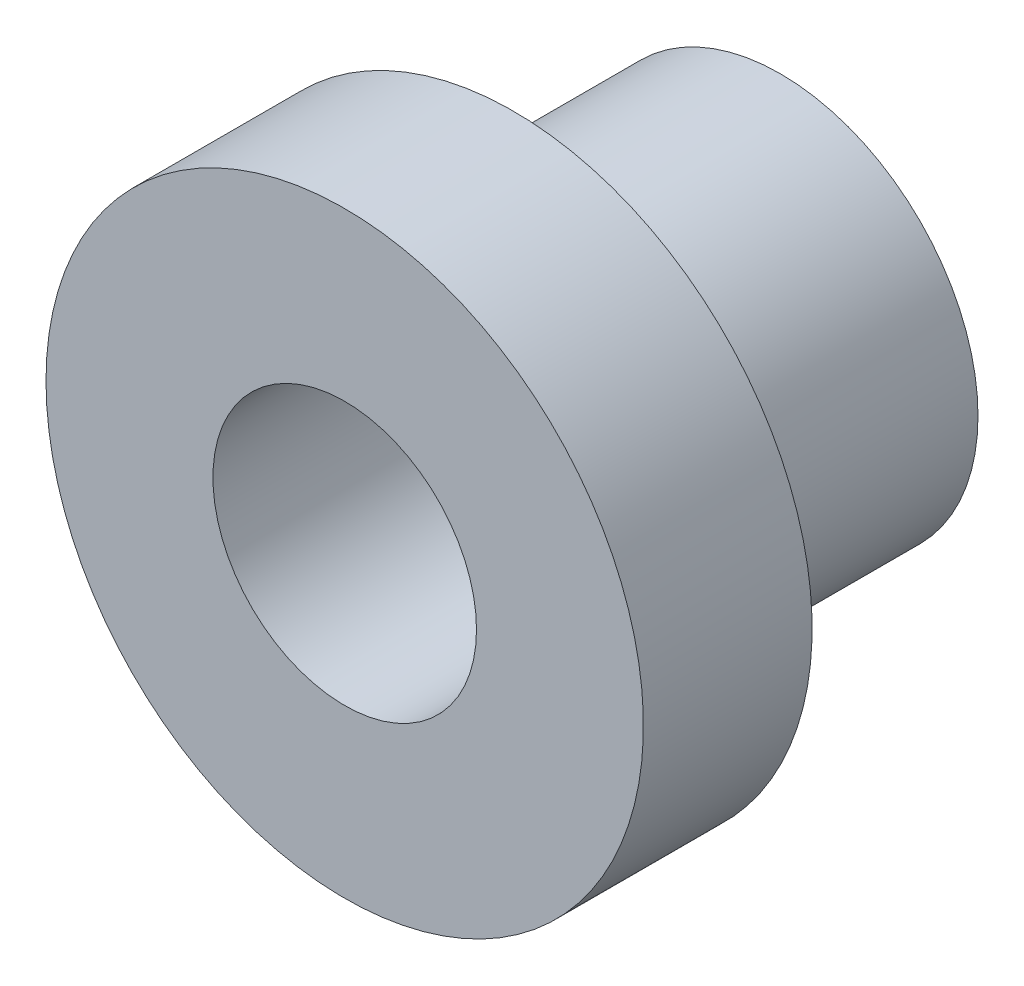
ISO-10303-21;
HEADER;
FILE_DESCRIPTION(('STEP AP214'),'2;1');
FILE_NAME('part.step','',(''),(''),'','','');
FILE_SCHEMA(('AUTOMOTIVE_DESIGN { 1 0 10303 214 1 1 1 1 }'));
ENDSEC;
DATA;
#1=APPLICATION_CONTEXT('core data for automotive mechanical design processes');
#2=APPLICATION_PROTOCOL_DEFINITION('international standard','automotive_design',2000,#1);
#3=PRODUCT_CONTEXT('',#1,'mechanical');
#4=PRODUCT('Part','Part','',(#3));
#5=PRODUCT_RELATED_PRODUCT_CATEGORY('part','',(#4));
#6=PRODUCT_DEFINITION_FORMATION('','',#4);
#7=PRODUCT_DEFINITION_CONTEXT('part definition',#1,'design');
#8=PRODUCT_DEFINITION('design','',#6,#7);
#9=PRODUCT_DEFINITION_SHAPE('','',#8);
#10=(LENGTH_UNIT() NAMED_UNIT(*) SI_UNIT(.MILLI.,.METRE.));
#11=(NAMED_UNIT(*) PLANE_ANGLE_UNIT() SI_UNIT($,.RADIAN.));
#12=(NAMED_UNIT(*) SI_UNIT($,.STERADIAN.) SOLID_ANGLE_UNIT());
#13=UNCERTAINTY_MEASURE_WITH_UNIT(LENGTH_MEASURE(1.E-05),#10,'distance_accuracy_value','');
#14=(GEOMETRIC_REPRESENTATION_CONTEXT(3) GLOBAL_UNCERTAINTY_ASSIGNED_CONTEXT((#13)) GLOBAL_UNIT_ASSIGNED_CONTEXT((#10,
#11,#12)) REPRESENTATION_CONTEXT('',''));
#15=CARTESIAN_POINT('',(0.,0.,0.));
#16=DIRECTION('',(0.,0.,1.));
#17=DIRECTION('',(1.,0.,0.));
#18=AXIS2_PLACEMENT_3D('',#15,#16,#17);
#19=CARTESIAN_POINT('',(0.,0.,0.));
#20=DIRECTION('',(0.,0.,1.));
#21=DIRECTION('',(1.,0.,0.));
#22=AXIS2_PLACEMENT_3D('',#19,#20,#21);
#23=PLANE('',#22);
#24=CARTESIAN_POINT('',(0.,0.,0.));
#25=DIRECTION('',(0.,0.,1.));
#26=DIRECTION('',(1.,0.,0.));
#27=AXIS2_PLACEMENT_3D('',#24,#25,#26);
#28=CIRCLE('',#27,10.795);
#29=CARTESIAN_POINT('',(-10.795,0.,0.));
#30=VERTEX_POINT('',#29);
#31=EDGE_CURVE('E50',#30,#30,#28,.T.);
#32=ORIENTED_EDGE('',*,*,#31,.F.);
#33=EDGE_LOOP('',(#32));
#34=FACE_BOUND('',#33,.T.);
#35=CARTESIAN_POINT('',(0.,0.,0.));
#36=DIRECTION('',(0.,0.,1.));
#37=DIRECTION('',(1.,0.,0.));
#38=AXIS2_PLACEMENT_3D('',#35,#36,#37);
#39=CIRCLE('',#38,7.1374);
#40=CARTESIAN_POINT('',(7.1374,0.,0.));
#41=VERTEX_POINT('',#40);
#42=EDGE_CURVE('E10',#41,#41,#39,.F.);
#43=ORIENTED_EDGE('',*,*,#42,.F.);
#44=EDGE_LOOP('',(#43));
#45=FACE_BOUND('',#44,.T.);
#46=ADVANCED_FACE('F36',(#34,#45),#23,.F.);
#47=CARTESIAN_POINT('',(0.,0.,6.096));
#48=DIRECTION('',(0.,0.,-1.));
#49=DIRECTION('',(-1.,0.,0.));
#50=AXIS2_PLACEMENT_3D('',#47,#48,#49);
#51=CYLINDRICAL_SURFACE('',#50,10.795);
#52=CARTESIAN_POINT('',(0.,0.,6.096));
#53=DIRECTION('',(0.,0.,1.));
#54=DIRECTION('',(1.,0.,0.));
#55=AXIS2_PLACEMENT_3D('',#52,#53,#54);
#56=CIRCLE('',#55,10.795);
#57=CARTESIAN_POINT('',(-10.795,0.,6.096));
#58=VERTEX_POINT('',#57);
#59=EDGE_CURVE('E44',#58,#58,#56,.T.);
#60=CARTESIAN_POINT('',(-10.795,0.,6.096));
#61=CARTESIAN_POINT('',(-10.795,0.,6.0325));
#62=CARTESIAN_POINT('',(-10.795,0.,5.969));
#63=CARTESIAN_POINT('',(-10.795,0.,5.842));
#64=CARTESIAN_POINT('',(-10.795,0.,5.7785));
#65=CARTESIAN_POINT('',(-10.795,0.,5.6515));
#66=CARTESIAN_POINT('',(-10.795,0.,5.588));
#67=CARTESIAN_POINT('',(-10.795,0.,5.461));
#68=CARTESIAN_POINT('',(-10.795,0.,5.3975));
#69=CARTESIAN_POINT('',(-10.795,0.,5.2705));
#70=CARTESIAN_POINT('',(-10.795,0.,5.207));
#71=CARTESIAN_POINT('',(-10.795,0.,5.08));
#72=CARTESIAN_POINT('',(-10.795,0.,5.0165));
#73=CARTESIAN_POINT('',(-10.795,0.,4.8895));
#74=CARTESIAN_POINT('',(-10.795,0.,4.826));
#75=CARTESIAN_POINT('',(-10.795,0.,4.699));
#76=CARTESIAN_POINT('',(-10.795,0.,4.6355));
#77=CARTESIAN_POINT('',(-10.795,0.,4.5085));
#78=CARTESIAN_POINT('',(-10.795,0.,4.445));
#79=CARTESIAN_POINT('',(-10.795,0.,4.318));
#80=CARTESIAN_POINT('',(-10.795,0.,4.2545));
#81=CARTESIAN_POINT('',(-10.795,0.,4.1275));
#82=CARTESIAN_POINT('',(-10.795,0.,4.064));
#83=CARTESIAN_POINT('',(-10.795,0.,3.937));
#84=CARTESIAN_POINT('',(-10.795,0.,3.8735));
#85=CARTESIAN_POINT('',(-10.795,0.,3.7465));
#86=CARTESIAN_POINT('',(-10.795,0.,3.683));
#87=CARTESIAN_POINT('',(-10.795,0.,3.556));
#88=CARTESIAN_POINT('',(-10.795,0.,3.4925));
#89=CARTESIAN_POINT('',(-10.795,0.,3.3655));
#90=CARTESIAN_POINT('',(-10.795,0.,3.302));
#91=CARTESIAN_POINT('',(-10.795,0.,3.175));
#92=CARTESIAN_POINT('',(-10.795,0.,3.1115));
#93=CARTESIAN_POINT('',(-10.795,0.,2.9845));
#94=CARTESIAN_POINT('',(-10.795,0.,2.921));
#95=CARTESIAN_POINT('',(-10.795,0.,2.794));
#96=CARTESIAN_POINT('',(-10.795,0.,2.7305));
#97=CARTESIAN_POINT('',(-10.795,0.,2.6035));
#98=CARTESIAN_POINT('',(-10.795,0.,2.54));
#99=CARTESIAN_POINT('',(-10.795,0.,2.413));
#100=CARTESIAN_POINT('',(-10.795,0.,2.3495));
#101=CARTESIAN_POINT('',(-10.795,0.,2.2225));
#102=CARTESIAN_POINT('',(-10.795,0.,2.159));
#103=CARTESIAN_POINT('',(-10.795,0.,2.032));
#104=CARTESIAN_POINT('',(-10.795,0.,1.9685));
#105=CARTESIAN_POINT('',(-10.795,0.,1.8415));
#106=CARTESIAN_POINT('',(-10.795,0.,1.778));
#107=CARTESIAN_POINT('',(-10.795,0.,1.651));
#108=CARTESIAN_POINT('',(-10.795,0.,1.5875));
#109=CARTESIAN_POINT('',(-10.795,0.,1.4605));
#110=CARTESIAN_POINT('',(-10.795,0.,1.397));
#111=CARTESIAN_POINT('',(-10.795,0.,1.27));
#112=CARTESIAN_POINT('',(-10.795,0.,1.2065));
#113=CARTESIAN_POINT('',(-10.795,0.,1.0795));
#114=CARTESIAN_POINT('',(-10.795,0.,1.016));
#115=CARTESIAN_POINT('',(-10.795,0.,0.889));
#116=CARTESIAN_POINT('',(-10.795,0.,0.8255));
#117=CARTESIAN_POINT('',(-10.795,0.,0.6985));
#118=CARTESIAN_POINT('',(-10.795,0.,0.635));
#119=CARTESIAN_POINT('',(-10.795,0.,0.508));
#120=CARTESIAN_POINT('',(-10.795,0.,0.4445));
#121=CARTESIAN_POINT('',(-10.795,0.,0.3175));
#122=CARTESIAN_POINT('',(-10.795,0.,0.254));
#123=CARTESIAN_POINT('',(-10.795,0.,0.127));
#124=CARTESIAN_POINT('',(-10.795,0.,0.0634999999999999));
#125=CARTESIAN_POINT('',(-10.795,0.,0.));
#126=B_SPLINE_CURVE_WITH_KNOTS('',3,(#60,#61,#62,#63,#64,#65,#66,#67,#68,#69,#70,#71,#72,#73,
#74,#75,#76,#77,#78,#79,#80,#81,#82,#83,#84,#85,#86,#87,#88,#89,#90,#91,#92,#93,#94,#95,#96,#97,
#98,#99,#100,#101,#102,#103,#104,#105,#106,#107,#108,#109,#110,#111,#112,#113,#114,#115,#116,
#117,#118,#119,#120,#121,#122,#123,#124,#125),.UNSPECIFIED.,.F.,.F.,(4,2,2,2,2,2,2,2,2,2,2,2,2,
2,2,2,2,2,2,2,2,2,2,2,2,2,2,2,2,2,2,2,4),(0.,0.190500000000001,0.381,0.5715,0.762000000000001,
0.9525,1.143,1.3335,1.524,1.7145,1.905,2.0955,2.286,2.4765,2.667,2.8575,3.048,3.2385,3.429,
3.6195,3.81,4.0005,4.191,4.3815,4.572,4.7625,4.953,5.1435,5.334,5.5245,5.715,5.9055,6.096),.UNSPECIFIED.);
#127=EDGE_CURVE('BSEAM38',#58,#30,#126,.T.);
#128=ORIENTED_EDGE('',*,*,#59,.F.);
#129=ORIENTED_EDGE('',*,*,#31,.T.);
#130=ORIENTED_EDGE('',*,*,#127,.T.);
#131=ORIENTED_EDGE('',*,*,#127,.F.);
#132=EDGE_LOOP('',(#128,#130,#129,#131));
#133=FACE_BOUND('',#132,.T.);
#134=ADVANCED_FACE('F38',(#133),#51,.T.);
#135=CARTESIAN_POINT('',(0.,0.,6.096));
#136=DIRECTION('',(0.,0.,1.));
#137=DIRECTION('',(1.,0.,0.));
#138=AXIS2_PLACEMENT_3D('',#135,#136,#137);
#139=PLANE('',#138);
#140=CARTESIAN_POINT('',(0.,0.,6.096));
#141=DIRECTION('',(0.,0.,1.));
#142=DIRECTION('',(1.,0.,0.));
#143=AXIS2_PLACEMENT_3D('',#140,#141,#142);
#144=CIRCLE('',#143,4.7625);
#145=CARTESIAN_POINT('',(4.7625,0.,6.096));
#146=VERTEX_POINT('',#145);
#147=EDGE_CURVE('E61',#146,#146,#144,.T.);
#148=ORIENTED_EDGE('',*,*,#147,.F.);
#149=EDGE_LOOP('',(#148));
#150=FACE_BOUND('',#149,.T.);
#151=ORIENTED_EDGE('',*,*,#59,.T.);
#152=EDGE_LOOP('',(#151));
#153=FACE_BOUND('',#152,.T.);
#154=ADVANCED_FACE('F78',(#150,#153),#139,.T.);
#155=CARTESIAN_POINT('',(0.,0.,-9.652));
#156=DIRECTION('',(0.,0.,1.));
#157=DIRECTION('',(1.,0.,0.));
#158=AXIS2_PLACEMENT_3D('',#155,#156,#157);
#159=CYLINDRICAL_SURFACE('',#158,7.1374);
#160=CARTESIAN_POINT('',(0.,0.,-9.652));
#161=DIRECTION('',(0.,0.,-1.));
#162=DIRECTION('',(-1.,0.,0.));
#163=AXIS2_PLACEMENT_3D('',#160,#161,#162);
#164=CIRCLE('',#163,7.1374);
#165=CARTESIAN_POINT('',(-7.1374,0.,-9.652));
#166=VERTEX_POINT('',#165);
#167=EDGE_CURVE('E55',#166,#166,#164,.T.);
#168=ORIENTED_EDGE('',*,*,#167,.F.);
#169=EDGE_LOOP('',(#168));
#170=FACE_BOUND('',#169,.T.);
#171=ORIENTED_EDGE('',*,*,#42,.T.);
#172=EDGE_LOOP('',(#171));
#173=FACE_BOUND('',#172,.T.);
#174=ADVANCED_FACE('F80',(#170,#173),#159,.T.);
#175=CARTESIAN_POINT('',(0.,0.,-9.652));
#176=DIRECTION('',(0.,0.,-1.));
#177=DIRECTION('',(-1.,0.,0.));
#178=AXIS2_PLACEMENT_3D('',#175,#176,#177);
#179=PLANE('',#178);
#180=CARTESIAN_POINT('',(0.,0.,-9.652));
#181=DIRECTION('',(0.,0.,1.));
#182=DIRECTION('',(1.,0.,0.));
#183=AXIS2_PLACEMENT_3D('',#180,#181,#182);
#184=CIRCLE('',#183,4.7625);
#185=CARTESIAN_POINT('',(4.7625,0.,-9.652));
#186=VERTEX_POINT('',#185);
#187=EDGE_CURVE('E60',#186,#186,#184,.T.);
#188=ORIENTED_EDGE('',*,*,#187,.T.);
#189=EDGE_LOOP('',(#188));
#190=FACE_BOUND('',#189,.T.);
#191=ORIENTED_EDGE('',*,*,#167,.T.);
#192=EDGE_LOOP('',(#191));
#193=FACE_BOUND('',#192,.T.);
#194=ADVANCED_FACE('F69',(#190,#193),#179,.T.);
#195=CARTESIAN_POINT('',(0.,0.,-9.652));
#196=DIRECTION('',(0.,0.,1.));
#197=DIRECTION('',(1.,0.,0.));
#198=AXIS2_PLACEMENT_3D('',#195,#196,#197);
#199=CYLINDRICAL_SURFACE('',#198,4.7625);
#200=ORIENTED_EDGE('',*,*,#187,.F.);
#201=EDGE_LOOP('',(#200));
#202=FACE_BOUND('',#201,.T.);
#203=ORIENTED_EDGE('',*,*,#147,.T.);
#204=EDGE_LOOP('',(#203));
#205=FACE_BOUND('',#204,.T.);
#206=ADVANCED_FACE('F72',(#202,#205),#199,.F.);
#207=CLOSED_SHELL('',(#46,#134,#154,#174,#194,#206));
#208=MANIFOLD_SOLID_BREP('B2',#207);
#209=ADVANCED_BREP_SHAPE_REPRESENTATION('',(#18,#208),#14);
#210=SHAPE_DEFINITION_REPRESENTATION(#9,#209);
ENDSEC;
END-ISO-10303-21;
